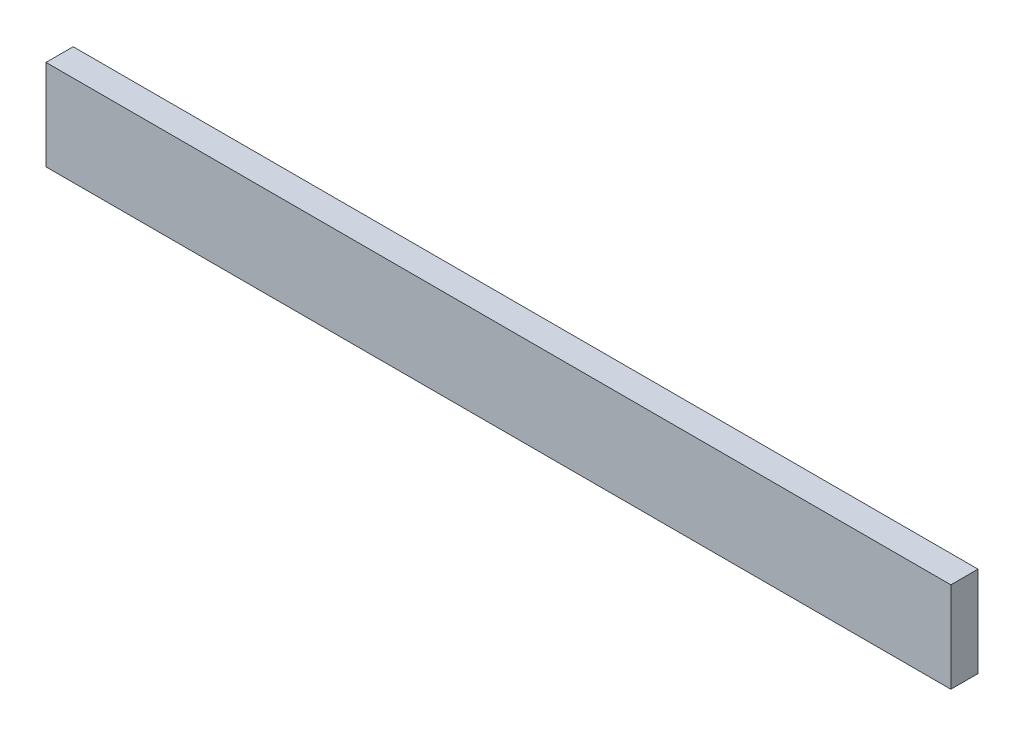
ISO-10303-21;
HEADER;
FILE_DESCRIPTION(('STEP AP214'),'2;1');
FILE_NAME('part.step','',(''),(''),'','','');
FILE_SCHEMA(('AUTOMOTIVE_DESIGN { 1 0 10303 214 1 1 1 1 }'));
ENDSEC;
DATA;
#1=APPLICATION_CONTEXT('core data for automotive mechanical design processes');
#2=APPLICATION_PROTOCOL_DEFINITION('international standard','automotive_design',2000,#1);
#3=PRODUCT_CONTEXT('',#1,'mechanical');
#4=PRODUCT('Part','Part','',(#3));
#5=PRODUCT_RELATED_PRODUCT_CATEGORY('part','',(#4));
#6=PRODUCT_DEFINITION_FORMATION('','',#4);
#7=PRODUCT_DEFINITION_CONTEXT('part definition',#1,'design');
#8=PRODUCT_DEFINITION('design','',#6,#7);
#9=PRODUCT_DEFINITION_SHAPE('','',#8);
#10=(LENGTH_UNIT() NAMED_UNIT(*) SI_UNIT(.MILLI.,.METRE.));
#11=(NAMED_UNIT(*) PLANE_ANGLE_UNIT() SI_UNIT($,.RADIAN.));
#12=(NAMED_UNIT(*) SI_UNIT($,.STERADIAN.) SOLID_ANGLE_UNIT());
#13=UNCERTAINTY_MEASURE_WITH_UNIT(LENGTH_MEASURE(1.E-05),#10,'distance_accuracy_value','');
#14=(GEOMETRIC_REPRESENTATION_CONTEXT(3) GLOBAL_UNCERTAINTY_ASSIGNED_CONTEXT((#13)) GLOBAL_UNIT_ASSIGNED_CONTEXT((#10,
#11,#12)) REPRESENTATION_CONTEXT('',''));
#15=CARTESIAN_POINT('',(0.,0.,0.));
#16=DIRECTION('',(0.,0.,1.));
#17=DIRECTION('',(1.,0.,0.));
#18=AXIS2_PLACEMENT_3D('',#15,#16,#17);
#19=CARTESIAN_POINT('',(0.,0.,6.));
#20=DIRECTION('',(0.,0.,1.));
#21=DIRECTION('',(1.,0.,0.));
#22=AXIS2_PLACEMENT_3D('',#19,#20,#21);
#23=PLANE('',#22);
#24=DIRECTION('',(1.,0.,0.));
#25=VECTOR('',#24,1.);
#26=CARTESIAN_POINT('',(-100.,-10.,6.));
#27=LINE('',#26,#25);
#28=CARTESIAN_POINT('',(-100.,-10.,6.));
#29=VERTEX_POINT('',#28);
#30=CARTESIAN_POINT('',(100.,-10.,6.));
#31=VERTEX_POINT('',#30);
#32=EDGE_CURVE('E81',#29,#31,#27,.T.);
#33=ORIENTED_EDGE('',*,*,#32,.T.);
#34=DIRECTION('',(0.,1.,0.));
#35=VECTOR('',#34,1.);
#36=CARTESIAN_POINT('',(100.,-10.,6.));
#37=LINE('',#36,#35);
#38=CARTESIAN_POINT('',(100.,10.,6.));
#39=VERTEX_POINT('',#38);
#40=EDGE_CURVE('E105',#31,#39,#37,.T.);
#41=ORIENTED_EDGE('',*,*,#40,.T.);
#42=DIRECTION('',(-1.,0.,0.));
#43=VECTOR('',#42,1.);
#44=CARTESIAN_POINT('',(100.,10.,6.));
#45=LINE('',#44,#43);
#46=CARTESIAN_POINT('',(-100.,10.,6.));
#47=VERTEX_POINT('',#46);
#48=EDGE_CURVE('E73',#39,#47,#45,.T.);
#49=ORIENTED_EDGE('',*,*,#48,.T.);
#50=DIRECTION('',(0.,-1.,0.));
#51=VECTOR('',#50,1.);
#52=CARTESIAN_POINT('',(-100.,10.,6.));
#53=LINE('',#52,#51);
#54=EDGE_CURVE('E10',#47,#29,#53,.T.);
#55=ORIENTED_EDGE('',*,*,#54,.T.);
#56=EDGE_LOOP('',(#33,#41,#49,#55));
#57=FACE_BOUND('',#56,.T.);
#58=ADVANCED_FACE('F16',(#57),#23,.T.);
#59=CARTESIAN_POINT('',(0.,0.,0.));
#60=DIRECTION('',(0.,0.,1.));
#61=DIRECTION('',(1.,0.,0.));
#62=AXIS2_PLACEMENT_3D('',#59,#60,#61);
#63=PLANE('',#62);
#64=DIRECTION('',(0.,-1.,0.));
#65=VECTOR('',#64,1.);
#66=CARTESIAN_POINT('',(-100.,10.,0.));
#67=LINE('',#66,#65);
#68=CARTESIAN_POINT('',(-100.,10.,0.));
#69=VERTEX_POINT('',#68);
#70=CARTESIAN_POINT('',(-100.,-10.,0.));
#71=VERTEX_POINT('',#70);
#72=EDGE_CURVE('E24',#69,#71,#67,.T.);
#73=ORIENTED_EDGE('',*,*,#72,.F.);
#74=DIRECTION('',(-1.,0.,0.));
#75=VECTOR('',#74,1.);
#76=CARTESIAN_POINT('',(100.,10.,0.));
#77=LINE('',#76,#75);
#78=CARTESIAN_POINT('',(100.,10.,0.));
#79=VERTEX_POINT('',#78);
#80=EDGE_CURVE('E109',#79,#69,#77,.T.);
#81=ORIENTED_EDGE('',*,*,#80,.F.);
#82=DIRECTION('',(0.,1.,0.));
#83=VECTOR('',#82,1.);
#84=CARTESIAN_POINT('',(100.,-10.,0.));
#85=LINE('',#84,#83);
#86=CARTESIAN_POINT('',(100.,-10.,0.));
#87=VERTEX_POINT('',#86);
#88=EDGE_CURVE('E83',#87,#79,#85,.T.);
#89=ORIENTED_EDGE('',*,*,#88,.F.);
#90=DIRECTION('',(1.,0.,0.));
#91=VECTOR('',#90,1.);
#92=CARTESIAN_POINT('',(-100.,-10.,0.));
#93=LINE('',#92,#91);
#94=EDGE_CURVE('E79',#71,#87,#93,.T.);
#95=ORIENTED_EDGE('',*,*,#94,.F.);
#96=EDGE_LOOP('',(#73,#81,#89,#95));
#97=FACE_BOUND('',#96,.T.);
#98=ADVANCED_FACE('F85',(#97),#63,.F.);
#99=CARTESIAN_POINT('',(-100.,10.,0.));
#100=DIRECTION('',(1.,0.,0.));
#101=DIRECTION('',(0.,1.,0.));
#102=AXIS2_PLACEMENT_3D('',#99,#100,#101);
#103=PLANE('',#102);
#104=ORIENTED_EDGE('',*,*,#72,.T.);
#105=DIRECTION('',(0.,0.,1.));
#106=VECTOR('',#105,1.);
#107=CARTESIAN_POINT('',(-100.,-10.,0.));
#108=LINE('',#107,#106);
#109=EDGE_CURVE('E67',#71,#29,#108,.T.);
#110=ORIENTED_EDGE('',*,*,#109,.T.);
#111=ORIENTED_EDGE('',*,*,#54,.F.);
#112=DIRECTION('',(0.,0.,1.));
#113=VECTOR('',#112,1.);
#114=CARTESIAN_POINT('',(-100.,10.,0.));
#115=LINE('',#114,#113);
#116=EDGE_CURVE('E70',#69,#47,#115,.T.);
#117=ORIENTED_EDGE('',*,*,#116,.F.);
#118=EDGE_LOOP('',(#104,#110,#111,#117));
#119=FACE_BOUND('',#118,.T.);
#120=ADVANCED_FACE('F66',(#119),#103,.F.);
#121=CARTESIAN_POINT('',(100.,10.,0.));
#122=DIRECTION('',(0.,-1.,0.));
#123=DIRECTION('',(0.,0.,-1.));
#124=AXIS2_PLACEMENT_3D('',#121,#122,#123);
#125=PLANE('',#124);
#126=ORIENTED_EDGE('',*,*,#80,.T.);
#127=ORIENTED_EDGE('',*,*,#116,.T.);
#128=ORIENTED_EDGE('',*,*,#48,.F.);
#129=DIRECTION('',(0.,0.,1.));
#130=VECTOR('',#129,1.);
#131=CARTESIAN_POINT('',(100.,10.,0.));
#132=LINE('',#131,#130);
#133=EDGE_CURVE('E101',#79,#39,#132,.T.);
#134=ORIENTED_EDGE('',*,*,#133,.F.);
#135=EDGE_LOOP('',(#126,#127,#128,#134));
#136=FACE_BOUND('',#135,.T.);
#137=ADVANCED_FACE('F117',(#136),#125,.F.);
#138=CARTESIAN_POINT('',(100.,-10.,0.));
#139=DIRECTION('',(-1.,0.,0.));
#140=DIRECTION('',(0.,0.,1.));
#141=AXIS2_PLACEMENT_3D('',#138,#139,#140);
#142=PLANE('',#141);
#143=ORIENTED_EDGE('',*,*,#88,.T.);
#144=ORIENTED_EDGE('',*,*,#133,.T.);
#145=ORIENTED_EDGE('',*,*,#40,.F.);
#146=DIRECTION('',(0.,0.,1.));
#147=VECTOR('',#146,1.);
#148=CARTESIAN_POINT('',(100.,-10.,0.));
#149=LINE('',#148,#147);
#150=EDGE_CURVE('E89',#87,#31,#149,.T.);
#151=ORIENTED_EDGE('',*,*,#150,.F.);
#152=EDGE_LOOP('',(#143,#144,#145,#151));
#153=FACE_BOUND('',#152,.T.);
#154=ADVANCED_FACE('F119',(#153),#142,.F.);
#155=CARTESIAN_POINT('',(-100.,-10.,0.));
#156=DIRECTION('',(0.,1.,0.));
#157=DIRECTION('',(1.,0.,0.));
#158=AXIS2_PLACEMENT_3D('',#155,#156,#157);
#159=PLANE('',#158);
#160=ORIENTED_EDGE('',*,*,#94,.T.);
#161=ORIENTED_EDGE('',*,*,#150,.T.);
#162=ORIENTED_EDGE('',*,*,#32,.F.);
#163=ORIENTED_EDGE('',*,*,#109,.F.);
#164=EDGE_LOOP('',(#160,#161,#162,#163));
#165=FACE_BOUND('',#164,.T.);
#166=ADVANCED_FACE('F77',(#165),#159,.F.);
#167=CLOSED_SHELL('',(#58,#98,#120,#137,#154,#166));
#168=MANIFOLD_SOLID_BREP('B1',#167);
#169=ADVANCED_BREP_SHAPE_REPRESENTATION('',(#18,#168),#14);
#170=SHAPE_DEFINITION_REPRESENTATION(#9,#169);
ENDSEC;
END-ISO-10303-21;
